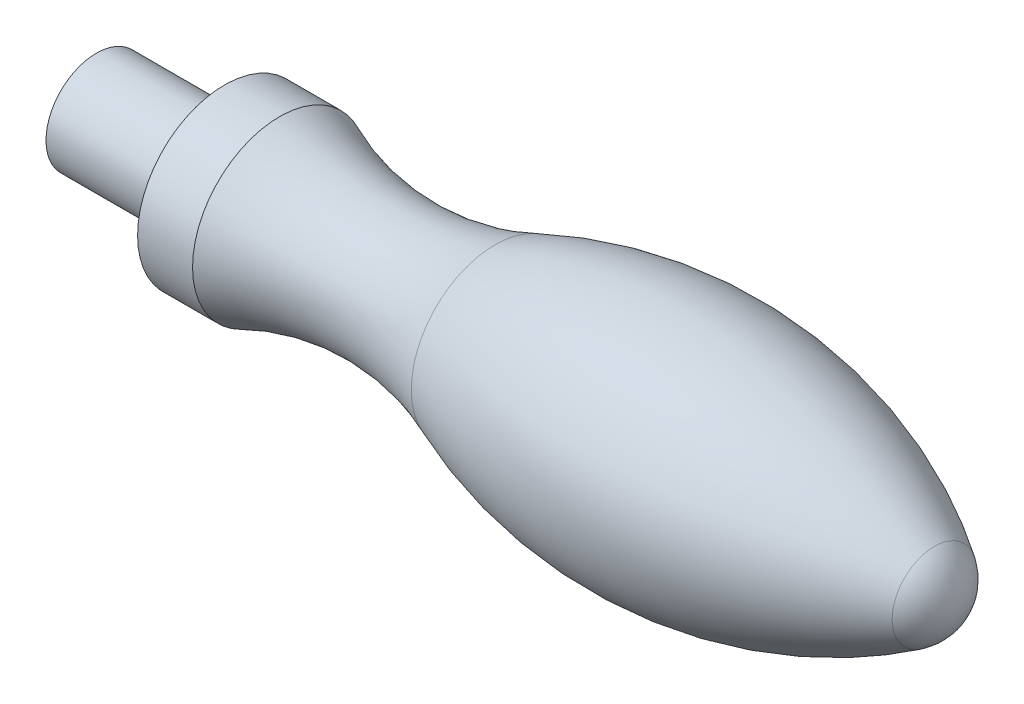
ISO-10303-21;
HEADER;
FILE_DESCRIPTION(('STEP AP214'),'2;1');
FILE_NAME('part.step','',(''),(''),'','','');
FILE_SCHEMA(('AUTOMOTIVE_DESIGN { 1 0 10303 214 1 1 1 1 }'));
ENDSEC;
DATA;
#1=APPLICATION_CONTEXT('core data for automotive mechanical design processes');
#2=APPLICATION_PROTOCOL_DEFINITION('international standard','automotive_design',2000,#1);
#3=PRODUCT_CONTEXT('',#1,'mechanical');
#4=PRODUCT('Part','Part','',(#3));
#5=PRODUCT_RELATED_PRODUCT_CATEGORY('part','',(#4));
#6=PRODUCT_DEFINITION_FORMATION('','',#4);
#7=PRODUCT_DEFINITION_CONTEXT('part definition',#1,'design');
#8=PRODUCT_DEFINITION('design','',#6,#7);
#9=PRODUCT_DEFINITION_SHAPE('','',#8);
#10=(LENGTH_UNIT() NAMED_UNIT(*) SI_UNIT(.MILLI.,.METRE.));
#11=(NAMED_UNIT(*) PLANE_ANGLE_UNIT() SI_UNIT($,.RADIAN.));
#12=(NAMED_UNIT(*) SI_UNIT($,.STERADIAN.) SOLID_ANGLE_UNIT());
#13=UNCERTAINTY_MEASURE_WITH_UNIT(LENGTH_MEASURE(1.E-05),#10,'distance_accuracy_value','');
#14=(GEOMETRIC_REPRESENTATION_CONTEXT(3) GLOBAL_UNCERTAINTY_ASSIGNED_CONTEXT((#13)) GLOBAL_UNIT_ASSIGNED_CONTEXT((#10,
#11,#12)) REPRESENTATION_CONTEXT('',''));
#15=CARTESIAN_POINT('',(0.,0.,0.));
#16=DIRECTION('',(0.,0.,1.));
#17=DIRECTION('',(1.,0.,0.));
#18=AXIS2_PLACEMENT_3D('',#15,#16,#17);
#19=CARTESIAN_POINT('',(-76.588275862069,0.,0.));
#20=DIRECTION('',(1.,0.,0.));
#21=DIRECTION('',(0.,0.,-1.));
#22=AXIS2_PLACEMENT_3D('',#19,#20,#21);
#23=PLANE('',#22);
#24=CARTESIAN_POINT('',(-76.5882758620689,0.,0.));
#25=DIRECTION('',(-1.,0.,0.));
#26=DIRECTION('',(0.,0.,1.));
#27=AXIS2_PLACEMENT_3D('',#24,#25,#26);
#28=CIRCLE('',#27,5.5);
#29=CARTESIAN_POINT('',(-76.5882758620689,0.,5.5));
#30=VERTEX_POINT('',#29);
#31=EDGE_CURVE('E10',#30,#30,#28,.T.);
#32=ORIENTED_EDGE('',*,*,#31,.T.);
#33=EDGE_LOOP('',(#32));
#34=FACE_BOUND('',#33,.T.);
#35=ADVANCED_FACE('F27',(#34),#23,.F.);
#36=CARTESIAN_POINT('',(-76.588275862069,0.,0.));
#37=DIRECTION('',(-1.,0.,0.));
#38=DIRECTION('',(0.,0.,1.));
#39=AXIS2_PLACEMENT_3D('',#36,#37,#38);
#40=CYLINDRICAL_SURFACE('',#39,5.5);
#41=ORIENTED_EDGE('',*,*,#31,.F.);
#42=EDGE_LOOP('',(#41));
#43=FACE_BOUND('',#42,.T.);
#44=CARTESIAN_POINT('',(-62.5882758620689,0.,0.));
#45=DIRECTION('',(-1.,0.,0.));
#46=DIRECTION('',(0.,0.,1.));
#47=AXIS2_PLACEMENT_3D('',#44,#45,#46);
#48=CIRCLE('',#47,5.5);
#49=CARTESIAN_POINT('',(-62.5882758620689,0.,5.5));
#50=VERTEX_POINT('',#49);
#51=EDGE_CURVE('E33',#50,#50,#48,.T.);
#52=ORIENTED_EDGE('',*,*,#51,.T.);
#53=EDGE_LOOP('',(#52));
#54=FACE_BOUND('',#53,.T.);
#55=ADVANCED_FACE('F65',(#43,#54),#40,.T.);
#56=CARTESIAN_POINT('',(-62.5882758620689,5.5,0.));
#57=DIRECTION('',(1.,0.,0.));
#58=DIRECTION('',(0.,0.,-1.));
#59=AXIS2_PLACEMENT_3D('',#56,#57,#58);
#60=PLANE('',#59);
#61=ORIENTED_EDGE('',*,*,#51,.F.);
#62=EDGE_LOOP('',(#61));
#63=FACE_BOUND('',#62,.T.);
#64=CARTESIAN_POINT('',(-62.5882758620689,0.,0.));
#65=DIRECTION('',(-1.,0.,0.));
#66=DIRECTION('',(0.,0.,1.));
#67=AXIS2_PLACEMENT_3D('',#64,#65,#66);
#68=CIRCLE('',#67,9.5);
#69=CARTESIAN_POINT('',(-62.5882758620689,0.,9.5));
#70=VERTEX_POINT('',#69);
#71=EDGE_CURVE('E37',#70,#70,#68,.T.);
#72=ORIENTED_EDGE('',*,*,#71,.T.);
#73=EDGE_LOOP('',(#72));
#74=FACE_BOUND('',#73,.T.);
#75=ADVANCED_FACE('F69',(#63,#74),#60,.F.);
#76=CARTESIAN_POINT('',(-76.588275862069,0.,0.));
#77=DIRECTION('',(-1.,0.,0.));
#78=DIRECTION('',(0.,0.,1.));
#79=AXIS2_PLACEMENT_3D('',#76,#77,#78);
#80=CYLINDRICAL_SURFACE('',#79,9.5);
#81=ORIENTED_EDGE('',*,*,#71,.F.);
#82=EDGE_LOOP('',(#81));
#83=FACE_BOUND('',#82,.T.);
#84=CARTESIAN_POINT('',(-56.5882758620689,0.,0.));
#85=DIRECTION('',(-1.,0.,0.));
#86=DIRECTION('',(0.,0.,1.));
#87=AXIS2_PLACEMENT_3D('',#84,#85,#86);
#88=CIRCLE('',#87,9.5);
#89=CARTESIAN_POINT('',(-56.5882758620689,0.,9.5));
#90=VERTEX_POINT('',#89);
#91=EDGE_CURVE('E41',#90,#90,#88,.T.);
#92=ORIENTED_EDGE('',*,*,#91,.T.);
#93=EDGE_LOOP('',(#92));
#94=FACE_BOUND('',#93,.T.);
#95=ADVANCED_FACE('F74',(#83,#94),#80,.T.);
#96=CARTESIAN_POINT('',(-44.4075994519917,0.,0.));
#97=DIRECTION('',(-1.,0.,0.));
#98=DIRECTION('',(0.,0.,1.));
#99=AXIS2_PLACEMENT_3D('',#96,#97,#98);
#100=TOROIDAL_SURFACE('',#99,36.9158917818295,30.);
#101=ORIENTED_EDGE('',*,*,#91,.F.);
#102=EDGE_LOOP('',(#101));
#103=FACE_BOUND('',#102,.T.);
#104=CARTESIAN_POINT('',(-33.0674497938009,0.,0.));
#105=DIRECTION('',(-1.,0.,0.));
#106=DIRECTION('',(0.,0.,1.));
#107=AXIS2_PLACEMENT_3D('',#104,#105,#106);
#108=CIRCLE('',#107,9.1417850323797);
#109=CARTESIAN_POINT('',(-33.0674497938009,0.,9.1417850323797));
#110=VERTEX_POINT('',#109);
#111=EDGE_CURVE('E46',#110,#110,#108,.T.);
#112=ORIENTED_EDGE('',*,*,#111,.T.);
#113=EDGE_LOOP('',(#112));
#114=FACE_BOUND('',#113,.T.);
#115=ADVANCED_FACE('F61',(#103,#114),#100,.F.);
#116=CARTESIAN_POINT('',(-13.4111903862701,0.,0.));
#117=DIRECTION('',(-1.,0.,0.));
#118=DIRECTION('',(0.,0.,1.));
#119=AXIS2_PLACEMENT_3D('',#116,#117,#118);
#120=DEGENERATE_TOROIDAL_SURFACE('',#119,39.,52.,.F.);
#121=ORIENTED_EDGE('',*,*,#111,.F.);
#122=EDGE_LOOP('',(#121));
#123=FACE_BOUND('',#122,.T.);
#124=CARTESIAN_POINT('',(14.9069075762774,0.,0.));
#125=DIRECTION('',(-1.,0.,0.));
#126=DIRECTION('',(0.,0.,1.));
#127=AXIS2_PLACEMENT_3D('',#124,#125,#126);
#128=CIRCLE('',#127,4.61290322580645);
#129=CARTESIAN_POINT('',(14.9069075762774,0.,4.61290322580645));
#130=VERTEX_POINT('',#129);
#131=EDGE_CURVE('E49',#130,#130,#128,.T.);
#132=ORIENTED_EDGE('',*,*,#131,.T.);
#133=EDGE_LOOP('',(#132));
#134=FACE_BOUND('',#133,.T.);
#135=ADVANCED_FACE('F53',(#123,#134),#120,.F.);
#136=CARTESIAN_POINT('',(11.911724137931,0.,0.));
#137=DIRECTION('',(-1.,0.,0.));
#138=DIRECTION('',(0.,1.,0.));
#139=AXIS2_PLACEMENT_3D('',#136,#137,#138);
#140=SPHERICAL_SURFACE('',#139,5.5);
#141=ORIENTED_EDGE('',*,*,#131,.F.);
#142=EDGE_LOOP('',(#141));
#143=FACE_BOUND('',#142,.T.);
#144=ADVANCED_FACE('F55',(#143),#140,.T.);
#145=CLOSED_SHELL('',(#35,#55,#75,#95,#115,#135,#144));
#146=MANIFOLD_SOLID_BREP('B2',#145);
#147=ADVANCED_BREP_SHAPE_REPRESENTATION('',(#18,#146),#14);
#148=SHAPE_DEFINITION_REPRESENTATION(#9,#147);
ENDSEC;
END-ISO-10303-21;
